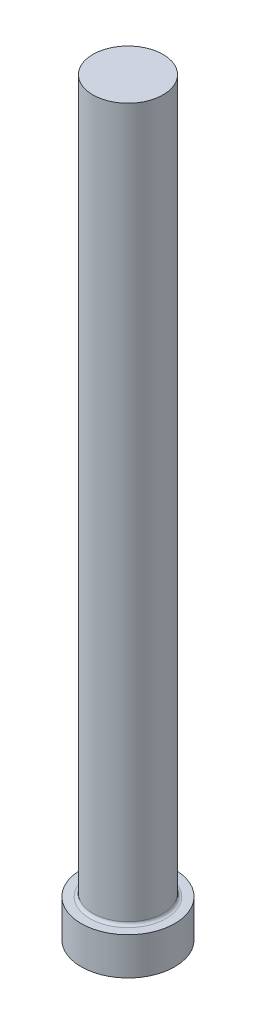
from build123d import *


with BuildPart() as part:
    # Sketch1 → Revolve3 (revolve)
    with BuildSketch(Plane.XY, mode=Mode.PRIVATE) as revolve3_sk:
        with BuildLine():
            Line((0, 0), (3.9624, 0))
            Line((3.9624, 0), (3.9624, 3.175))
            Line((3.9624, 3.175), (3.2258, 3.175))
            ThreePointArc((3.2258, 3.175), (3.046194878, 3.249394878), (2.9718, 3.429))
            Line((2.9718, 3.429), (2.9718, 63.5))
            Line((2.9718, 63.5), (0, 63.5))
            Line((0, 63.5), (0, 0))
        make_face()
    revolve(revolve3_sk.sketch.rotate(Axis((0, 0, 0), (0, -1, 0)), 90), axis=Axis((0, 0, 0), (0, -1, 0)))


solid = part.part
